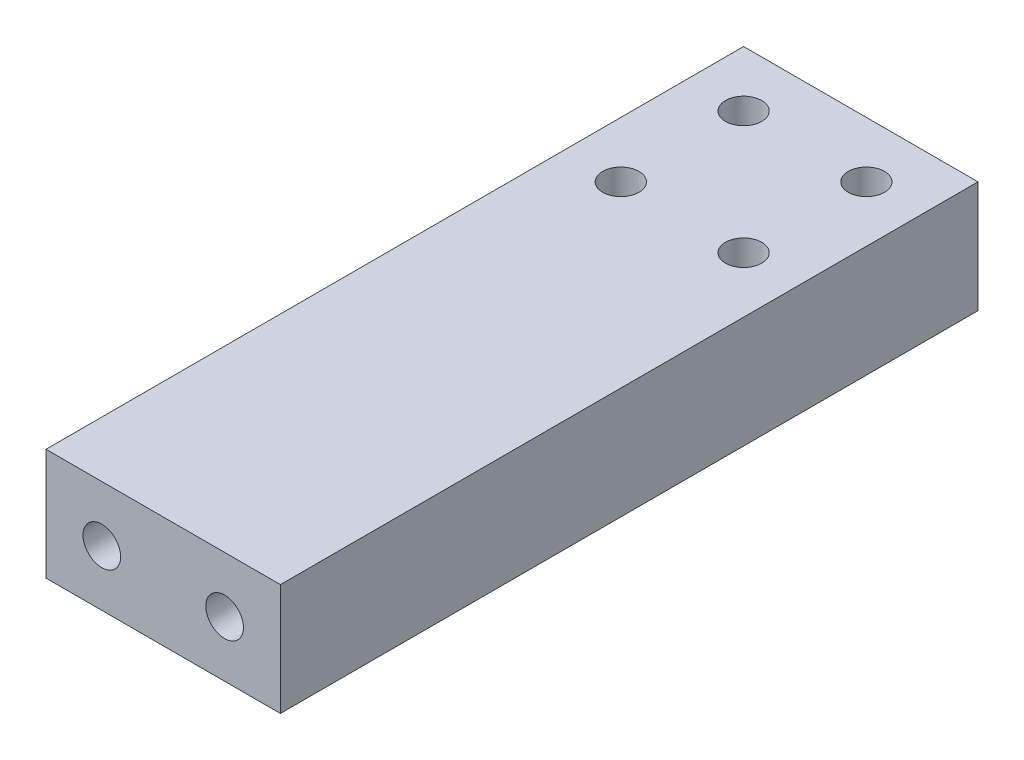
ISO-10303-21;
HEADER;
FILE_DESCRIPTION(('STEP AP214'),'2;1');
FILE_NAME('part.step','',(''),(''),'','','');
FILE_SCHEMA(('AUTOMOTIVE_DESIGN { 1 0 10303 214 1 1 1 1 }'));
ENDSEC;
DATA;
#1=APPLICATION_CONTEXT('core data for automotive mechanical design processes');
#2=APPLICATION_PROTOCOL_DEFINITION('international standard','automotive_design',2000,#1);
#3=PRODUCT_CONTEXT('',#1,'mechanical');
#4=PRODUCT('Part','Part','',(#3));
#5=PRODUCT_RELATED_PRODUCT_CATEGORY('part','',(#4));
#6=PRODUCT_DEFINITION_FORMATION('','',#4);
#7=PRODUCT_DEFINITION_CONTEXT('part definition',#1,'design');
#8=PRODUCT_DEFINITION('design','',#6,#7);
#9=PRODUCT_DEFINITION_SHAPE('','',#8);
#10=(LENGTH_UNIT() NAMED_UNIT(*) SI_UNIT(.MILLI.,.METRE.));
#11=(NAMED_UNIT(*) PLANE_ANGLE_UNIT() SI_UNIT($,.RADIAN.));
#12=(NAMED_UNIT(*) SI_UNIT($,.STERADIAN.) SOLID_ANGLE_UNIT());
#13=UNCERTAINTY_MEASURE_WITH_UNIT(LENGTH_MEASURE(1.E-05),#10,'distance_accuracy_value','');
#14=(GEOMETRIC_REPRESENTATION_CONTEXT(3) GLOBAL_UNCERTAINTY_ASSIGNED_CONTEXT((#13)) GLOBAL_UNIT_ASSIGNED_CONTEXT((#10,
#11,#12)) REPRESENTATION_CONTEXT('',''));
#15=CARTESIAN_POINT('',(0.,0.,0.));
#16=DIRECTION('',(0.,0.,1.));
#17=DIRECTION('',(1.,0.,0.));
#18=AXIS2_PLACEMENT_3D('',#15,#16,#17);
#19=CARTESIAN_POINT('',(0.,0.,125.));
#20=DIRECTION('',(1.,0.,0.));
#21=DIRECTION('',(0.,0.,-1.));
#22=AXIS2_PLACEMENT_3D('',#19,#20,#21);
#23=PLANE('',#22);
#24=DIRECTION('',(0.,-1.,0.));
#25=VECTOR('',#24,1.);
#26=CARTESIAN_POINT('',(0.,0.,0.));
#27=LINE('',#26,#25);
#28=CARTESIAN_POINT('',(0.,20.,0.));
#29=VERTEX_POINT('',#28);
#30=CARTESIAN_POINT('',(0.,0.,0.));
#31=VERTEX_POINT('',#30);
#32=EDGE_CURVE('E76',#29,#31,#27,.T.);
#33=ORIENTED_EDGE('',*,*,#32,.T.);
#34=DIRECTION('',(0.,0.,-1.));
#35=VECTOR('',#34,1.);
#36=CARTESIAN_POINT('',(0.,0.,125.));
#37=LINE('',#36,#35);
#38=CARTESIAN_POINT('',(0.,0.,125.));
#39=VERTEX_POINT('',#38);
#40=EDGE_CURVE('E11',#39,#31,#37,.T.);
#41=ORIENTED_EDGE('',*,*,#40,.F.);
#42=DIRECTION('',(0.,-1.,0.));
#43=VECTOR('',#42,1.);
#44=CARTESIAN_POINT('',(0.,0.,125.));
#45=LINE('',#44,#43);
#46=CARTESIAN_POINT('',(0.,20.,125.));
#47=VERTEX_POINT('',#46);
#48=EDGE_CURVE('E99',#47,#39,#45,.T.);
#49=ORIENTED_EDGE('',*,*,#48,.F.);
#50=DIRECTION('',(0.,0.,-1.));
#51=VECTOR('',#50,1.);
#52=CARTESIAN_POINT('',(0.,20.,125.));
#53=LINE('',#52,#51);
#54=EDGE_CURVE('E88',#47,#29,#53,.T.);
#55=ORIENTED_EDGE('',*,*,#54,.T.);
#56=EDGE_LOOP('',(#33,#41,#49,#55));
#57=FACE_BOUND('',#56,.T.);
#58=ADVANCED_FACE('F32',(#57),#23,.F.);
#59=CARTESIAN_POINT('',(0.,0.,125.));
#60=DIRECTION('',(0.,1.,0.));
#61=DIRECTION('',(0.,0.,1.));
#62=AXIS2_PLACEMENT_3D('',#59,#60,#61);
#63=PLANE('',#62);
#64=CARTESIAN_POINT('',(32.0000000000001,0.,31.9999999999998));
#65=DIRECTION('',(0.,1.,0.));
#66=DIRECTION('',(0.,0.,1.));
#67=AXIS2_PLACEMENT_3D('',#64,#65,#66);
#68=CIRCLE('',#67,3.25);
#69=CARTESIAN_POINT('',(32.0000000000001,0.,35.2499999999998));
#70=VERTEX_POINT('',#69);
#71=EDGE_CURVE('E137',#70,#70,#68,.F.);
#72=ORIENTED_EDGE('',*,*,#71,.F.);
#73=EDGE_LOOP('',(#72));
#74=FACE_BOUND('',#73,.T.);
#75=CARTESIAN_POINT('',(10.0000000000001,0.,32.));
#76=DIRECTION('',(0.,1.,0.));
#77=DIRECTION('',(0.,0.,1.));
#78=AXIS2_PLACEMENT_3D('',#75,#76,#77);
#79=CIRCLE('',#78,3.25);
#80=CARTESIAN_POINT('',(10.0000000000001,0.,35.25));
#81=VERTEX_POINT('',#80);
#82=EDGE_CURVE('E141',#81,#81,#79,.F.);
#83=ORIENTED_EDGE('',*,*,#82,.F.);
#84=EDGE_LOOP('',(#83));
#85=FACE_BOUND('',#84,.T.);
#86=CARTESIAN_POINT('',(32.,0.,9.99999999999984));
#87=DIRECTION('',(0.,1.,0.));
#88=DIRECTION('',(0.,0.,1.));
#89=AXIS2_PLACEMENT_3D('',#86,#87,#88);
#90=CIRCLE('',#89,3.25);
#91=CARTESIAN_POINT('',(32.,0.,13.2499999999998));
#92=VERTEX_POINT('',#91);
#93=EDGE_CURVE('E145',#92,#92,#90,.F.);
#94=ORIENTED_EDGE('',*,*,#93,.F.);
#95=EDGE_LOOP('',(#94));
#96=FACE_BOUND('',#95,.T.);
#97=CARTESIAN_POINT('',(10.,0.,9.99999999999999));
#98=DIRECTION('',(0.,1.,0.));
#99=DIRECTION('',(0.,0.,1.));
#100=AXIS2_PLACEMENT_3D('',#97,#98,#99);
#101=CIRCLE('',#100,3.25);
#102=CARTESIAN_POINT('',(10.,0.,13.25));
#103=VERTEX_POINT('',#102);
#104=EDGE_CURVE('E89',#103,#103,#101,.F.);
#105=ORIENTED_EDGE('',*,*,#104,.F.);
#106=EDGE_LOOP('',(#105));
#107=FACE_BOUND('',#106,.T.);
#108=DIRECTION('',(1.,0.,0.));
#109=VECTOR('',#108,1.);
#110=CARTESIAN_POINT('',(0.,0.,0.));
#111=LINE('',#110,#109);
#112=CARTESIAN_POINT('',(42.,0.,0.));
#113=VERTEX_POINT('',#112);
#114=EDGE_CURVE('E72',#31,#113,#111,.T.);
#115=ORIENTED_EDGE('',*,*,#114,.T.);
#116=DIRECTION('',(0.,0.,-1.));
#117=VECTOR('',#116,1.);
#118=CARTESIAN_POINT('',(42.,0.,125.));
#119=LINE('',#118,#117);
#120=CARTESIAN_POINT('',(42.,0.,125.));
#121=VERTEX_POINT('',#120);
#122=EDGE_CURVE('E39',#121,#113,#119,.T.);
#123=ORIENTED_EDGE('',*,*,#122,.F.);
#124=DIRECTION('',(1.,0.,0.));
#125=VECTOR('',#124,1.);
#126=CARTESIAN_POINT('',(0.,0.,125.));
#127=LINE('',#126,#125);
#128=EDGE_CURVE('E84',#39,#121,#127,.T.);
#129=ORIENTED_EDGE('',*,*,#128,.F.);
#130=ORIENTED_EDGE('',*,*,#40,.T.);
#131=EDGE_LOOP('',(#115,#123,#129,#130));
#132=FACE_BOUND('',#131,.T.);
#133=ADVANCED_FACE('F83',(#74,#85,#96,#107,#132),#63,.F.);
#134=CARTESIAN_POINT('',(42.,0.,125.));
#135=DIRECTION('',(-1.,0.,0.));
#136=DIRECTION('',(0.,0.,1.));
#137=AXIS2_PLACEMENT_3D('',#134,#135,#136);
#138=PLANE('',#137);
#139=DIRECTION('',(0.,1.,0.));
#140=VECTOR('',#139,1.);
#141=CARTESIAN_POINT('',(42.,0.,0.));
#142=LINE('',#141,#140);
#143=CARTESIAN_POINT('',(42.,20.,0.));
#144=VERTEX_POINT('',#143);
#145=EDGE_CURVE('E77',#113,#144,#142,.T.);
#146=ORIENTED_EDGE('',*,*,#145,.T.);
#147=DIRECTION('',(0.,0.,-1.));
#148=VECTOR('',#147,1.);
#149=CARTESIAN_POINT('',(42.,20.,125.));
#150=LINE('',#149,#148);
#151=CARTESIAN_POINT('',(42.,20.,125.));
#152=VERTEX_POINT('',#151);
#153=EDGE_CURVE('E105',#152,#144,#150,.T.);
#154=ORIENTED_EDGE('',*,*,#153,.F.);
#155=DIRECTION('',(0.,1.,0.));
#156=VECTOR('',#155,1.);
#157=CARTESIAN_POINT('',(42.,0.,125.));
#158=LINE('',#157,#156);
#159=EDGE_CURVE('E51',#121,#152,#158,.T.);
#160=ORIENTED_EDGE('',*,*,#159,.F.);
#161=ORIENTED_EDGE('',*,*,#122,.T.);
#162=EDGE_LOOP('',(#146,#154,#160,#161));
#163=FACE_BOUND('',#162,.T.);
#164=ADVANCED_FACE('F108',(#163),#138,.F.);
#165=CARTESIAN_POINT('',(0.,20.,125.));
#166=DIRECTION('',(0.,-1.,0.));
#167=DIRECTION('',(0.,0.,-1.));
#168=AXIS2_PLACEMENT_3D('',#165,#166,#167);
#169=PLANE('',#168);
#170=CARTESIAN_POINT('',(32.0000000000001,20.,31.9999999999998));
#171=DIRECTION('',(0.,1.,0.));
#172=DIRECTION('',(0.,0.,1.));
#173=AXIS2_PLACEMENT_3D('',#170,#171,#172);
#174=CIRCLE('',#173,3.25);
#175=CARTESIAN_POINT('',(32.0000000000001,20.,35.2499999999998));
#176=VERTEX_POINT('',#175);
#177=EDGE_CURVE('E198',#176,#176,#174,.T.);
#178=ORIENTED_EDGE('',*,*,#177,.F.);
#179=EDGE_LOOP('',(#178));
#180=FACE_BOUND('',#179,.T.);
#181=CARTESIAN_POINT('',(10.0000000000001,20.,32.));
#182=DIRECTION('',(0.,1.,0.));
#183=DIRECTION('',(0.,0.,1.));
#184=AXIS2_PLACEMENT_3D('',#181,#182,#183);
#185=CIRCLE('',#184,3.25);
#186=CARTESIAN_POINT('',(10.0000000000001,20.,35.25));
#187=VERTEX_POINT('',#186);
#188=EDGE_CURVE('E202',#187,#187,#185,.T.);
#189=ORIENTED_EDGE('',*,*,#188,.F.);
#190=EDGE_LOOP('',(#189));
#191=FACE_BOUND('',#190,.T.);
#192=CARTESIAN_POINT('',(32.,20.,9.99999999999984));
#193=DIRECTION('',(0.,1.,0.));
#194=DIRECTION('',(0.,0.,1.));
#195=AXIS2_PLACEMENT_3D('',#192,#193,#194);
#196=CIRCLE('',#195,3.25);
#197=CARTESIAN_POINT('',(32.,20.,13.2499999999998));
#198=VERTEX_POINT('',#197);
#199=EDGE_CURVE('E206',#198,#198,#196,.T.);
#200=ORIENTED_EDGE('',*,*,#199,.F.);
#201=EDGE_LOOP('',(#200));
#202=FACE_BOUND('',#201,.T.);
#203=CARTESIAN_POINT('',(10.,20.,9.99999999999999));
#204=DIRECTION('',(0.,1.,0.));
#205=DIRECTION('',(0.,0.,1.));
#206=AXIS2_PLACEMENT_3D('',#203,#204,#205);
#207=CIRCLE('',#206,3.25);
#208=CARTESIAN_POINT('',(10.,20.,13.25));
#209=VERTEX_POINT('',#208);
#210=EDGE_CURVE('E92',#209,#209,#207,.T.);
#211=ORIENTED_EDGE('',*,*,#210,.F.);
#212=EDGE_LOOP('',(#211));
#213=FACE_BOUND('',#212,.T.);
#214=DIRECTION('',(-1.,0.,0.));
#215=VECTOR('',#214,1.);
#216=CARTESIAN_POINT('',(0.,20.,0.));
#217=LINE('',#216,#215);
#218=EDGE_CURVE('E97',#144,#29,#217,.T.);
#219=ORIENTED_EDGE('',*,*,#218,.T.);
#220=ORIENTED_EDGE('',*,*,#54,.F.);
#221=DIRECTION('',(-1.,0.,0.));
#222=VECTOR('',#221,1.);
#223=CARTESIAN_POINT('',(0.,20.,125.));
#224=LINE('',#223,#222);
#225=EDGE_CURVE('E46',#152,#47,#224,.T.);
#226=ORIENTED_EDGE('',*,*,#225,.F.);
#227=ORIENTED_EDGE('',*,*,#153,.T.);
#228=EDGE_LOOP('',(#219,#220,#226,#227));
#229=FACE_BOUND('',#228,.T.);
#230=ADVANCED_FACE('F110',(#180,#191,#202,#213,#229),#169,.F.);
#231=CARTESIAN_POINT('',(0.,20.,125.));
#232=DIRECTION('',(0.,0.,-1.));
#233=DIRECTION('',(-1.,0.,0.));
#234=AXIS2_PLACEMENT_3D('',#231,#232,#233);
#235=PLANE('',#234);
#236=CARTESIAN_POINT('',(32.,10.,125.));
#237=DIRECTION('',(0.,0.,1.));
#238=DIRECTION('',(1.,0.,0.));
#239=AXIS2_PLACEMENT_3D('',#236,#237,#238);
#240=CIRCLE('',#239,3.375);
#241=CARTESIAN_POINT('',(35.375,10.,125.));
#242=VERTEX_POINT('',#241);
#243=EDGE_CURVE('E188',#242,#242,#240,.T.);
#244=ORIENTED_EDGE('',*,*,#243,.F.);
#245=EDGE_LOOP('',(#244));
#246=FACE_BOUND('',#245,.T.);
#247=CARTESIAN_POINT('',(10.,10.,125.));
#248=DIRECTION('',(0.,0.,1.));
#249=DIRECTION('',(1.,0.,0.));
#250=AXIS2_PLACEMENT_3D('',#247,#248,#249);
#251=CIRCLE('',#250,3.375);
#252=CARTESIAN_POINT('',(13.375,10.,125.));
#253=VERTEX_POINT('',#252);
#254=EDGE_CURVE('E187',#253,#253,#251,.T.);
#255=ORIENTED_EDGE('',*,*,#254,.F.);
#256=EDGE_LOOP('',(#255));
#257=FACE_BOUND('',#256,.T.);
#258=ORIENTED_EDGE('',*,*,#48,.T.);
#259=ORIENTED_EDGE('',*,*,#128,.T.);
#260=ORIENTED_EDGE('',*,*,#159,.T.);
#261=ORIENTED_EDGE('',*,*,#225,.T.);
#262=EDGE_LOOP('',(#258,#259,#260,#261));
#263=FACE_BOUND('',#262,.T.);
#264=ADVANCED_FACE('F111',(#246,#257,#263),#235,.F.);
#265=CARTESIAN_POINT('',(0.,20.,0.));
#266=DIRECTION('',(0.,0.,-1.));
#267=DIRECTION('',(-1.,0.,0.));
#268=AXIS2_PLACEMENT_3D('',#265,#266,#267);
#269=PLANE('',#268);
#270=ORIENTED_EDGE('',*,*,#32,.F.);
#271=ORIENTED_EDGE('',*,*,#218,.F.);
#272=ORIENTED_EDGE('',*,*,#145,.F.);
#273=ORIENTED_EDGE('',*,*,#114,.F.);
#274=EDGE_LOOP('',(#270,#271,#272,#273));
#275=FACE_BOUND('',#274,.T.);
#276=ADVANCED_FACE('F73',(#275),#269,.T.);
#277=CARTESIAN_POINT('',(10.,-0.001000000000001,9.99999999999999));
#278=DIRECTION('',(0.,1.,0.));
#279=DIRECTION('',(0.,0.,1.));
#280=AXIS2_PLACEMENT_3D('',#277,#278,#279);
#281=CYLINDRICAL_SURFACE('',#280,3.25);
#282=ORIENTED_EDGE('',*,*,#210,.T.);
#283=EDGE_LOOP('',(#282));
#284=FACE_BOUND('',#283,.T.);
#285=ORIENTED_EDGE('',*,*,#104,.T.);
#286=EDGE_LOOP('',(#285));
#287=FACE_BOUND('',#286,.T.);
#288=ADVANCED_FACE('F119',(#284,#287),#281,.F.);
#289=CARTESIAN_POINT('',(32.,-0.001000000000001,9.99999999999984));
#290=DIRECTION('',(0.,1.,0.));
#291=DIRECTION('',(0.,0.,1.));
#292=AXIS2_PLACEMENT_3D('',#289,#290,#291);
#293=CYLINDRICAL_SURFACE('',#292,3.25);
#294=ORIENTED_EDGE('',*,*,#199,.T.);
#295=EDGE_LOOP('',(#294));
#296=FACE_BOUND('',#295,.T.);
#297=ORIENTED_EDGE('',*,*,#93,.T.);
#298=EDGE_LOOP('',(#297));
#299=FACE_BOUND('',#298,.T.);
#300=ADVANCED_FACE('F149',(#296,#299),#293,.F.);
#301=CARTESIAN_POINT('',(10.0000000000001,-0.001000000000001,32.));
#302=DIRECTION('',(0.,1.,0.));
#303=DIRECTION('',(0.,0.,1.));
#304=AXIS2_PLACEMENT_3D('',#301,#302,#303);
#305=CYLINDRICAL_SURFACE('',#304,3.25);
#306=ORIENTED_EDGE('',*,*,#188,.T.);
#307=EDGE_LOOP('',(#306));
#308=FACE_BOUND('',#307,.T.);
#309=ORIENTED_EDGE('',*,*,#82,.T.);
#310=EDGE_LOOP('',(#309));
#311=FACE_BOUND('',#310,.T.);
#312=ADVANCED_FACE('F155',(#308,#311),#305,.F.);
#313=CARTESIAN_POINT('',(32.0000000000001,-0.001000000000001,31.9999999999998));
#314=DIRECTION('',(0.,1.,0.));
#315=DIRECTION('',(0.,0.,1.));
#316=AXIS2_PLACEMENT_3D('',#313,#314,#315);
#317=CYLINDRICAL_SURFACE('',#316,3.25);
#318=ORIENTED_EDGE('',*,*,#177,.T.);
#319=EDGE_LOOP('',(#318));
#320=FACE_BOUND('',#319,.T.);
#321=ORIENTED_EDGE('',*,*,#71,.T.);
#322=EDGE_LOOP('',(#321));
#323=FACE_BOUND('',#322,.T.);
#324=ADVANCED_FACE('F162',(#320,#323),#317,.F.);
#325=CARTESIAN_POINT('',(10.,10.,100.));
#326=DIRECTION('',(0.,0.,1.));
#327=DIRECTION('',(1.,0.,0.));
#328=AXIS2_PLACEMENT_3D('',#325,#326,#327);
#329=CYLINDRICAL_SURFACE('',#328,3.375);
#330=CARTESIAN_POINT('',(10.,10.,100.));
#331=DIRECTION('',(0.,0.,1.));
#332=DIRECTION('',(1.,0.,0.));
#333=AXIS2_PLACEMENT_3D('',#330,#331,#332);
#334=CIRCLE('',#333,3.375);
#335=CARTESIAN_POINT('',(13.375,10.,100.));
#336=VERTEX_POINT('',#335);
#337=EDGE_CURVE('E191',#336,#336,#334,.T.);
#338=ORIENTED_EDGE('',*,*,#337,.F.);
#339=EDGE_LOOP('',(#338));
#340=FACE_BOUND('',#339,.T.);
#341=ORIENTED_EDGE('',*,*,#254,.T.);
#342=EDGE_LOOP('',(#341));
#343=FACE_BOUND('',#342,.T.);
#344=ADVANCED_FACE('F166',(#340,#343),#329,.F.);
#345=CARTESIAN_POINT('',(10.,10.,100.));
#346=DIRECTION('',(0.,0.,1.));
#347=DIRECTION('',(1.,0.,0.));
#348=AXIS2_PLACEMENT_3D('',#345,#346,#347);
#349=PLANE('',#348);
#350=ORIENTED_EDGE('',*,*,#337,.T.);
#351=EDGE_LOOP('',(#350));
#352=FACE_BOUND('',#351,.T.);
#353=ADVANCED_FACE('F170',(#352),#349,.T.);
#354=CARTESIAN_POINT('',(32.,10.,100.));
#355=DIRECTION('',(0.,0.,1.));
#356=DIRECTION('',(1.,0.,0.));
#357=AXIS2_PLACEMENT_3D('',#354,#355,#356);
#358=CYLINDRICAL_SURFACE('',#357,3.375);
#359=CARTESIAN_POINT('',(32.,10.,100.));
#360=DIRECTION('',(0.,0.,1.));
#361=DIRECTION('',(1.,0.,0.));
#362=AXIS2_PLACEMENT_3D('',#359,#360,#361);
#363=CIRCLE('',#362,3.375);
#364=CARTESIAN_POINT('',(35.375,10.,100.));
#365=VERTEX_POINT('',#364);
#366=EDGE_CURVE('E186',#365,#365,#363,.T.);
#367=ORIENTED_EDGE('',*,*,#366,.F.);
#368=EDGE_LOOP('',(#367));
#369=FACE_BOUND('',#368,.T.);
#370=ORIENTED_EDGE('',*,*,#243,.T.);
#371=EDGE_LOOP('',(#370));
#372=FACE_BOUND('',#371,.T.);
#373=ADVANCED_FACE('F174',(#369,#372),#358,.F.);
#374=CARTESIAN_POINT('',(32.,10.,100.));
#375=DIRECTION('',(0.,0.,1.));
#376=DIRECTION('',(1.,0.,0.));
#377=AXIS2_PLACEMENT_3D('',#374,#375,#376);
#378=PLANE('',#377);
#379=ORIENTED_EDGE('',*,*,#366,.T.);
#380=EDGE_LOOP('',(#379));
#381=FACE_BOUND('',#380,.T.);
#382=ADVANCED_FACE('F178',(#381),#378,.T.);
#383=CLOSED_SHELL('',(#58,#133,#164,#230,#264,#276,#288,#300,#312,#324,#344,#353,#373,#382));
#384=MANIFOLD_SOLID_BREP('B2',#383);
#385=ADVANCED_BREP_SHAPE_REPRESENTATION('',(#18,#384),#14);
#386=SHAPE_DEFINITION_REPRESENTATION(#9,#385);
ENDSEC;
END-ISO-10303-21;
